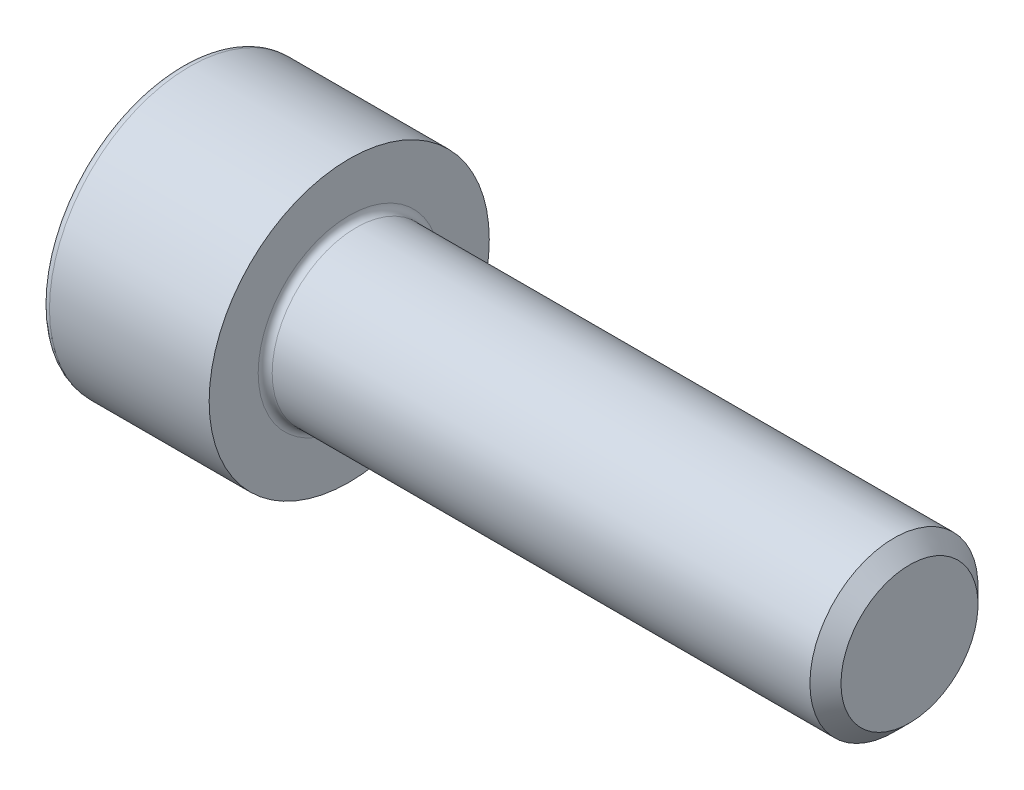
ISO-10303-21;
HEADER;
FILE_DESCRIPTION(('STEP AP214'),'2;1');
FILE_NAME('part.step','',(''),(''),'','','');
FILE_SCHEMA(('AUTOMOTIVE_DESIGN { 1 0 10303 214 1 1 1 1 }'));
ENDSEC;
DATA;
#1=APPLICATION_CONTEXT('core data for automotive mechanical design processes');
#2=APPLICATION_PROTOCOL_DEFINITION('international standard','automotive_design',2000,#1);
#3=PRODUCT_CONTEXT('',#1,'mechanical');
#4=PRODUCT('Part','Part','',(#3));
#5=PRODUCT_RELATED_PRODUCT_CATEGORY('part','',(#4));
#6=PRODUCT_DEFINITION_FORMATION('','',#4);
#7=PRODUCT_DEFINITION_CONTEXT('part definition',#1,'design');
#8=PRODUCT_DEFINITION('design','',#6,#7);
#9=PRODUCT_DEFINITION_SHAPE('','',#8);
#10=(LENGTH_UNIT() NAMED_UNIT(*) SI_UNIT(.MILLI.,.METRE.));
#11=(NAMED_UNIT(*) PLANE_ANGLE_UNIT() SI_UNIT($,.RADIAN.));
#12=(NAMED_UNIT(*) SI_UNIT($,.STERADIAN.) SOLID_ANGLE_UNIT());
#13=UNCERTAINTY_MEASURE_WITH_UNIT(LENGTH_MEASURE(1.E-05),#10,'distance_accuracy_value','');
#14=(GEOMETRIC_REPRESENTATION_CONTEXT(3) GLOBAL_UNCERTAINTY_ASSIGNED_CONTEXT((#13)) GLOBAL_UNIT_ASSIGNED_CONTEXT((#10,
#11,#12)) REPRESENTATION_CONTEXT('',''));
#15=CARTESIAN_POINT('',(0.,0.,0.));
#16=DIRECTION('',(0.,0.,1.));
#17=DIRECTION('',(1.,0.,0.));
#18=AXIS2_PLACEMENT_3D('',#15,#16,#17);
#19=CARTESIAN_POINT('',(0.,0.,0.));
#20=DIRECTION('',(-1.,0.,0.));
#21=DIRECTION('',(0.,0.,1.));
#22=AXIS2_PLACEMENT_3D('',#19,#20,#21);
#23=PLANE('',#22);
#24=DIRECTION('',(0.,-0.499999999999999,0.866025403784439));
#25=VECTOR('',#24,1.);
#26=CARTESIAN_POINT('',(0.,2.93524876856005,0.));
#27=LINE('',#26,#25);
#28=CARTESIAN_POINT('',(0.,2.93524876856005,0.));
#29=VERTEX_POINT('',#28);
#30=CARTESIAN_POINT('',(0.,1.46762438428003,2.542));
#31=VERTEX_POINT('',#30);
#32=EDGE_CURVE('E117',#29,#31,#27,.T.);
#33=ORIENTED_EDGE('',*,*,#32,.T.);
#34=DIRECTION('',(0.,1.,0.));
#35=VECTOR('',#34,1.);
#36=CARTESIAN_POINT('',(0.,-1.46762438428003,2.542));
#37=LINE('',#36,#35);
#38=CARTESIAN_POINT('',(0.,-1.46762438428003,2.542));
#39=VERTEX_POINT('',#38);
#40=EDGE_CURVE('E106',#39,#31,#37,.T.);
#41=ORIENTED_EDGE('',*,*,#40,.F.);
#42=DIRECTION('',(0.,-0.500000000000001,-0.866025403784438));
#43=VECTOR('',#42,1.);
#44=CARTESIAN_POINT('',(0.,-1.46762438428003,2.542));
#45=LINE('',#44,#43);
#46=CARTESIAN_POINT('',(0.,-2.93524876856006,0.));
#47=VERTEX_POINT('',#46);
#48=EDGE_CURVE('E116',#39,#47,#45,.T.);
#49=ORIENTED_EDGE('',*,*,#48,.T.);
#50=DIRECTION('',(0.,0.499999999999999,-0.866025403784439));
#51=VECTOR('',#50,1.);
#52=CARTESIAN_POINT('',(0.,-2.93524876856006,0.));
#53=LINE('',#52,#51);
#54=CARTESIAN_POINT('',(0.,-1.46762438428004,-2.542));
#55=VERTEX_POINT('',#54);
#56=EDGE_CURVE('E135',#47,#55,#53,.T.);
#57=ORIENTED_EDGE('',*,*,#56,.T.);
#58=DIRECTION('',(0.,-1.,0.));
#59=VECTOR('',#58,1.);
#60=CARTESIAN_POINT('',(0.,1.46762438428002,-2.542));
#61=LINE('',#60,#59);
#62=CARTESIAN_POINT('',(0.,1.46762438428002,-2.542));
#63=VERTEX_POINT('',#62);
#64=EDGE_CURVE('E138',#63,#55,#61,.T.);
#65=ORIENTED_EDGE('',*,*,#64,.F.);
#66=DIRECTION('',(0.,-0.500000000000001,-0.866025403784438));
#67=VECTOR('',#66,1.);
#68=CARTESIAN_POINT('',(0.,2.93524876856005,0.));
#69=LINE('',#68,#67);
#70=EDGE_CURVE('E131',#29,#63,#69,.T.);
#71=ORIENTED_EDGE('',*,*,#70,.F.);
#72=EDGE_LOOP('',(#33,#41,#49,#57,#65,#71));
#73=FACE_BOUND('',#72,.T.);
#74=CARTESIAN_POINT('',(0.,0.,0.));
#75=DIRECTION('',(-1.,0.,0.));
#76=DIRECTION('',(0.,0.,1.));
#77=AXIS2_PLACEMENT_3D('',#74,#75,#76);
#78=CIRCLE('',#77,4.7);
#79=CARTESIAN_POINT('',(0.,0.,4.7));
#80=VERTEX_POINT('',#79);
#81=EDGE_CURVE('E42',#80,#80,#78,.T.);
#82=ORIENTED_EDGE('',*,*,#81,.T.);
#83=EDGE_LOOP('',(#82));
#84=FACE_BOUND('',#83,.T.);
#85=ADVANCED_FACE('F35',(#73,#84),#23,.T.);
#86=CARTESIAN_POINT('',(-31.75,0.,0.));
#87=DIRECTION('',(-1.,0.,0.));
#88=DIRECTION('',(0.,0.,1.));
#89=AXIS2_PLACEMENT_3D('',#86,#87,#88);
#90=CYLINDRICAL_SURFACE('',#89,5.);
#91=CARTESIAN_POINT('',(0.300000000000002,0.,0.));
#92=DIRECTION('',(-1.,0.,0.));
#93=DIRECTION('',(0.,0.,1.));
#94=AXIS2_PLACEMENT_3D('',#91,#92,#93);
#95=CIRCLE('',#94,5.);
#96=CARTESIAN_POINT('',(0.300000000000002,0.,5.));
#97=VERTEX_POINT('',#96);
#98=EDGE_CURVE('E11',#97,#97,#95,.F.);
#99=ORIENTED_EDGE('',*,*,#98,.T.);
#100=EDGE_LOOP('',(#99));
#101=FACE_BOUND('',#100,.T.);
#102=CARTESIAN_POINT('',(6.,0.,0.));
#103=DIRECTION('',(-1.,0.,0.));
#104=DIRECTION('',(0.,0.,1.));
#105=AXIS2_PLACEMENT_3D('',#102,#103,#104);
#106=CIRCLE('',#105,5.);
#107=CARTESIAN_POINT('',(6.,0.,5.));
#108=VERTEX_POINT('',#107);
#109=EDGE_CURVE('E183',#108,#108,#106,.T.);
#110=ORIENTED_EDGE('',*,*,#109,.T.);
#111=EDGE_LOOP('',(#110));
#112=FACE_BOUND('',#111,.T.);
#113=ADVANCED_FACE('F210',(#101,#112),#90,.T.);
#114=CARTESIAN_POINT('',(6.,5.,0.));
#115=DIRECTION('',(1.,0.,0.));
#116=DIRECTION('',(0.,0.,-1.));
#117=AXIS2_PLACEMENT_3D('',#114,#115,#116);
#118=PLANE('',#117);
#119=CARTESIAN_POINT('',(6.,0.,0.));
#120=DIRECTION('',(1.,0.,0.));
#121=DIRECTION('',(0.,0.,-1.));
#122=AXIS2_PLACEMENT_3D('',#119,#120,#121);
#123=CIRCLE('',#122,3.25);
#124=CARTESIAN_POINT('',(6.,0.,-3.25));
#125=VERTEX_POINT('',#124);
#126=EDGE_CURVE('E186',#125,#125,#123,.F.);
#127=ORIENTED_EDGE('',*,*,#126,.T.);
#128=EDGE_LOOP('',(#127));
#129=FACE_BOUND('',#128,.T.);
#130=ORIENTED_EDGE('',*,*,#109,.F.);
#131=EDGE_LOOP('',(#130));
#132=FACE_BOUND('',#131,.T.);
#133=ADVANCED_FACE('F214',(#129,#132),#118,.T.);
#134=CARTESIAN_POINT('',(-31.75,0.,0.));
#135=DIRECTION('',(-1.,0.,0.));
#136=DIRECTION('',(0.,0.,1.));
#137=AXIS2_PLACEMENT_3D('',#134,#135,#136);
#138=CYLINDRICAL_SURFACE('',#137,3.);
#139=CARTESIAN_POINT('',(6.25,0.,0.));
#140=DIRECTION('',(1.,0.,0.));
#141=DIRECTION('',(0.,0.,-1.));
#142=AXIS2_PLACEMENT_3D('',#139,#140,#141);
#143=CIRCLE('',#142,3.);
#144=CARTESIAN_POINT('',(6.25,0.,-3.));
#145=VERTEX_POINT('',#144);
#146=EDGE_CURVE('E189',#145,#145,#143,.T.);
#147=ORIENTED_EDGE('',*,*,#146,.T.);
#148=EDGE_LOOP('',(#147));
#149=FACE_BOUND('',#148,.T.);
#150=CARTESIAN_POINT('',(25.4455,0.,0.));
#151=DIRECTION('',(-1.,0.,0.));
#152=DIRECTION('',(0.,0.,1.));
#153=AXIS2_PLACEMENT_3D('',#150,#151,#152);
#154=CIRCLE('',#153,3.);
#155=CARTESIAN_POINT('',(25.4455,0.,3.));
#156=VERTEX_POINT('',#155);
#157=EDGE_CURVE('E180',#156,#156,#154,.T.);
#158=ORIENTED_EDGE('',*,*,#157,.T.);
#159=EDGE_LOOP('',(#158));
#160=FACE_BOUND('',#159,.T.);
#161=ADVANCED_FACE('F219',(#149,#160),#138,.T.);
#162=CARTESIAN_POINT('',(26.,0.,0.));
#163=DIRECTION('',(-1.,0.,0.));
#164=DIRECTION('',(0.,0.,1.));
#165=AXIS2_PLACEMENT_3D('',#162,#163,#164);
#166=CONICAL_SURFACE('',#165,2.4455,0.785398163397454);
#167=ORIENTED_EDGE('',*,*,#157,.F.);
#168=EDGE_LOOP('',(#167));
#169=FACE_BOUND('',#168,.T.);
#170=CARTESIAN_POINT('',(26.,0.,0.));
#171=DIRECTION('',(-1.,0.,0.));
#172=DIRECTION('',(0.,0.,1.));
#173=AXIS2_PLACEMENT_3D('',#170,#171,#172);
#174=CIRCLE('',#173,2.4455);
#175=CARTESIAN_POINT('',(26.,0.,2.4455));
#176=VERTEX_POINT('',#175);
#177=EDGE_CURVE('E176',#176,#176,#174,.T.);
#178=ORIENTED_EDGE('',*,*,#177,.T.);
#179=EDGE_LOOP('',(#178));
#180=FACE_BOUND('',#179,.T.);
#181=ADVANCED_FACE('F226',(#169,#180),#166,.T.);
#182=CARTESIAN_POINT('',(26.,2.4455,0.));
#183=DIRECTION('',(1.,0.,0.));
#184=DIRECTION('',(0.,0.,-1.));
#185=AXIS2_PLACEMENT_3D('',#182,#183,#184);
#186=PLANE('',#185);
#187=ORIENTED_EDGE('',*,*,#177,.F.);
#188=EDGE_LOOP('',(#187));
#189=FACE_BOUND('',#188,.T.);
#190=ADVANCED_FACE('F204',(#189),#186,.T.);
#191=CARTESIAN_POINT('',(6.25,0.,0.));
#192=DIRECTION('',(1.,0.,0.));
#193=DIRECTION('',(0.,0.,-1.));
#194=AXIS2_PLACEMENT_3D('',#191,#192,#193);
#195=TOROIDAL_SURFACE('',#194,3.25,0.25);
#196=ORIENTED_EDGE('',*,*,#146,.F.);
#197=EDGE_LOOP('',(#196));
#198=FACE_BOUND('',#197,.T.);
#199=ORIENTED_EDGE('',*,*,#126,.F.);
#200=EDGE_LOOP('',(#199));
#201=FACE_BOUND('',#200,.T.);
#202=ADVANCED_FACE('F196',(#198,#201),#195,.F.);
#203=CARTESIAN_POINT('',(0.300000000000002,0.,0.));
#204=DIRECTION('',(-1.,0.,0.));
#205=DIRECTION('',(0.,0.,1.));
#206=AXIS2_PLACEMENT_3D('',#203,#204,#205);
#207=TOROIDAL_SURFACE('',#206,4.7,0.3);
#208=ORIENTED_EDGE('',*,*,#98,.F.);
#209=EDGE_LOOP('',(#208));
#210=FACE_BOUND('',#209,.T.);
#211=ORIENTED_EDGE('',*,*,#81,.F.);
#212=EDGE_LOOP('',(#211));
#213=FACE_BOUND('',#212,.T.);
#214=ADVANCED_FACE('F194',(#210,#213),#207,.T.);
#215=CARTESIAN_POINT('',(3.,2.93524876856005,0.));
#216=DIRECTION('',(0.,-0.866025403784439,-0.499999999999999));
#217=DIRECTION('',(0.,0.499999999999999,-0.866025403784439));
#218=AXIS2_PLACEMENT_3D('',#215,#216,#217);
#219=PLANE('',#218);
#220=ORIENTED_EDGE('',*,*,#32,.F.);
#221=DIRECTION('',(-1.,0.,0.));
#222=VECTOR('',#221,1.);
#223=CARTESIAN_POINT('',(3.,2.93524876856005,0.));
#224=LINE('',#223,#222);
#225=CARTESIAN_POINT('',(3.,2.93524876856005,0.));
#226=VERTEX_POINT('',#225);
#227=EDGE_CURVE('E161',#226,#29,#224,.T.);
#228=ORIENTED_EDGE('',*,*,#227,.F.);
#229=DIRECTION('',(0.,-0.499999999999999,0.866025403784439));
#230=VECTOR('',#229,1.);
#231=CARTESIAN_POINT('',(3.,2.93524876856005,0.));
#232=LINE('',#231,#230);
#233=CARTESIAN_POINT('',(3.,2.20143657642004,1.271));
#234=VERTEX_POINT('',#233);
#235=EDGE_CURVE('E141',#226,#234,#232,.T.);
#236=ORIENTED_EDGE('',*,*,#235,.T.);
#237=CARTESIAN_POINT('',(3.,1.46762438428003,2.542));
#238=VERTEX_POINT('',#237);
#239=EDGE_CURVE('E125',#234,#238,#232,.T.);
#240=ORIENTED_EDGE('',*,*,#239,.T.);
#241=DIRECTION('',(-1.,0.,0.));
#242=VECTOR('',#241,1.);
#243=CARTESIAN_POINT('',(3.,1.46762438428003,2.542));
#244=LINE('',#243,#242);
#245=EDGE_CURVE('E110',#238,#31,#244,.T.);
#246=ORIENTED_EDGE('',*,*,#245,.T.);
#247=EDGE_LOOP('',(#220,#228,#236,#240,#246));
#248=FACE_BOUND('',#247,.T.);
#249=ADVANCED_FACE('F121',(#248),#219,.T.);
#250=CARTESIAN_POINT('',(3.,-1.46762438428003,2.542));
#251=DIRECTION('',(0.,0.,1.));
#252=DIRECTION('',(0.,-1.,0.));
#253=AXIS2_PLACEMENT_3D('',#250,#251,#252);
#254=PLANE('',#253);
#255=ORIENTED_EDGE('',*,*,#40,.T.);
#256=ORIENTED_EDGE('',*,*,#245,.F.);
#257=DIRECTION('',(0.,1.,0.));
#258=VECTOR('',#257,1.);
#259=CARTESIAN_POINT('',(3.,-1.46762438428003,2.542));
#260=LINE('',#259,#258);
#261=CARTESIAN_POINT('',(3.,0.,2.542));
#262=VERTEX_POINT('',#261);
#263=EDGE_CURVE('E143',#262,#238,#260,.T.);
#264=ORIENTED_EDGE('',*,*,#263,.F.);
#265=CARTESIAN_POINT('',(3.,-1.46762438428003,2.542));
#266=VERTEX_POINT('',#265);
#267=EDGE_CURVE('E144',#266,#262,#260,.T.);
#268=ORIENTED_EDGE('',*,*,#267,.F.);
#269=DIRECTION('',(-1.,0.,0.));
#270=VECTOR('',#269,1.);
#271=CARTESIAN_POINT('',(3.,-1.46762438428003,2.542));
#272=LINE('',#271,#270);
#273=EDGE_CURVE('E112',#266,#39,#272,.T.);
#274=ORIENTED_EDGE('',*,*,#273,.T.);
#275=EDGE_LOOP('',(#255,#256,#264,#268,#274));
#276=FACE_BOUND('',#275,.T.);
#277=ADVANCED_FACE('F108',(#276),#254,.F.);
#278=CARTESIAN_POINT('',(3.,-1.46762438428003,2.542));
#279=DIRECTION('',(0.,0.866025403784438,-0.500000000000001));
#280=DIRECTION('',(0.,0.500000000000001,0.866025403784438));
#281=AXIS2_PLACEMENT_3D('',#278,#279,#280);
#282=PLANE('',#281);
#283=ORIENTED_EDGE('',*,*,#48,.F.);
#284=ORIENTED_EDGE('',*,*,#273,.F.);
#285=DIRECTION('',(0.,-0.500000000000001,-0.866025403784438));
#286=VECTOR('',#285,1.);
#287=CARTESIAN_POINT('',(3.,-1.46762438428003,2.542));
#288=LINE('',#287,#286);
#289=CARTESIAN_POINT('',(3.,-2.20143657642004,1.271));
#290=VERTEX_POINT('',#289);
#291=EDGE_CURVE('E148',#266,#290,#288,.T.);
#292=ORIENTED_EDGE('',*,*,#291,.T.);
#293=CARTESIAN_POINT('',(3.,-2.93524876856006,0.));
#294=VERTEX_POINT('',#293);
#295=EDGE_CURVE('E147',#290,#294,#288,.T.);
#296=ORIENTED_EDGE('',*,*,#295,.T.);
#297=DIRECTION('',(-1.,0.,0.));
#298=VECTOR('',#297,1.);
#299=CARTESIAN_POINT('',(3.,-2.93524876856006,0.));
#300=LINE('',#299,#298);
#301=EDGE_CURVE('E169',#294,#47,#300,.T.);
#302=ORIENTED_EDGE('',*,*,#301,.T.);
#303=EDGE_LOOP('',(#283,#284,#292,#296,#302));
#304=FACE_BOUND('',#303,.T.);
#305=ADVANCED_FACE('F277',(#304),#282,.T.);
#306=CARTESIAN_POINT('',(3.,-2.93524876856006,0.));
#307=DIRECTION('',(0.,0.866025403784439,0.499999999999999));
#308=DIRECTION('',(0.,-0.499999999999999,0.866025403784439));
#309=AXIS2_PLACEMENT_3D('',#306,#307,#308);
#310=PLANE('',#309);
#311=ORIENTED_EDGE('',*,*,#56,.F.);
#312=ORIENTED_EDGE('',*,*,#301,.F.);
#313=DIRECTION('',(0.,0.499999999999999,-0.866025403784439));
#314=VECTOR('',#313,1.);
#315=CARTESIAN_POINT('',(3.,-2.93524876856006,0.));
#316=LINE('',#315,#314);
#317=CARTESIAN_POINT('',(3.,-2.20143657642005,-1.271));
#318=VERTEX_POINT('',#317);
#319=EDGE_CURVE('E152',#294,#318,#316,.T.);
#320=ORIENTED_EDGE('',*,*,#319,.T.);
#321=CARTESIAN_POINT('',(3.,-1.46762438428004,-2.542));
#322=VERTEX_POINT('',#321);
#323=EDGE_CURVE('E151',#318,#322,#316,.T.);
#324=ORIENTED_EDGE('',*,*,#323,.T.);
#325=DIRECTION('',(-1.,0.,0.));
#326=VECTOR('',#325,1.);
#327=CARTESIAN_POINT('',(3.,-1.46762438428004,-2.542));
#328=LINE('',#327,#326);
#329=EDGE_CURVE('E166',#322,#55,#328,.T.);
#330=ORIENTED_EDGE('',*,*,#329,.T.);
#331=EDGE_LOOP('',(#311,#312,#320,#324,#330));
#332=FACE_BOUND('',#331,.T.);
#333=ADVANCED_FACE('F286',(#332),#310,.T.);
#334=CARTESIAN_POINT('',(3.,1.46762438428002,-2.542));
#335=DIRECTION('',(0.,0.,-1.));
#336=DIRECTION('',(0.,1.,0.));
#337=AXIS2_PLACEMENT_3D('',#334,#335,#336);
#338=PLANE('',#337);
#339=ORIENTED_EDGE('',*,*,#64,.T.);
#340=ORIENTED_EDGE('',*,*,#329,.F.);
#341=DIRECTION('',(0.,-1.,0.));
#342=VECTOR('',#341,1.);
#343=CARTESIAN_POINT('',(3.,1.46762438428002,-2.542));
#344=LINE('',#343,#342);
#345=CARTESIAN_POINT('',(3.,0.,-2.542));
#346=VERTEX_POINT('',#345);
#347=EDGE_CURVE('E155',#346,#322,#344,.T.);
#348=ORIENTED_EDGE('',*,*,#347,.F.);
#349=CARTESIAN_POINT('',(3.,1.46762438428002,-2.542));
#350=VERTEX_POINT('',#349);
#351=EDGE_CURVE('E49',#350,#346,#344,.T.);
#352=ORIENTED_EDGE('',*,*,#351,.F.);
#353=DIRECTION('',(-1.,0.,0.));
#354=VECTOR('',#353,1.);
#355=CARTESIAN_POINT('',(3.,1.46762438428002,-2.542));
#356=LINE('',#355,#354);
#357=EDGE_CURVE('E163',#350,#63,#356,.T.);
#358=ORIENTED_EDGE('',*,*,#357,.T.);
#359=EDGE_LOOP('',(#339,#340,#348,#352,#358));
#360=FACE_BOUND('',#359,.T.);
#361=ADVANCED_FACE('F296',(#360),#338,.F.);
#362=CARTESIAN_POINT('',(3.,2.93524876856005,0.));
#363=DIRECTION('',(0.,0.866025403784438,-0.500000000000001));
#364=DIRECTION('',(0.,0.500000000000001,0.866025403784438));
#365=AXIS2_PLACEMENT_3D('',#362,#363,#364);
#366=PLANE('',#365);
#367=ORIENTED_EDGE('',*,*,#70,.T.);
#368=ORIENTED_EDGE('',*,*,#357,.F.);
#369=DIRECTION('',(0.,-0.500000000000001,-0.866025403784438));
#370=VECTOR('',#369,1.);
#371=CARTESIAN_POINT('',(3.,2.93524876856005,0.));
#372=LINE('',#371,#370);
#373=CARTESIAN_POINT('',(3.,2.20143657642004,-1.271));
#374=VERTEX_POINT('',#373);
#375=EDGE_CURVE('E157',#374,#350,#372,.T.);
#376=ORIENTED_EDGE('',*,*,#375,.F.);
#377=EDGE_CURVE('E158',#226,#374,#372,.T.);
#378=ORIENTED_EDGE('',*,*,#377,.F.);
#379=ORIENTED_EDGE('',*,*,#227,.T.);
#380=EDGE_LOOP('',(#367,#368,#376,#378,#379));
#381=FACE_BOUND('',#380,.T.);
#382=ADVANCED_FACE('F306',(#381),#366,.F.);
#383=CARTESIAN_POINT('',(3.,2.93524876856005,0.));
#384=DIRECTION('',(1.,0.,0.));
#385=DIRECTION('',(0.,0.,-1.));
#386=AXIS2_PLACEMENT_3D('',#383,#384,#385);
#387=PLANE('',#386);
#388=ORIENTED_EDGE('',*,*,#347,.T.);
#389=ORIENTED_EDGE('',*,*,#323,.F.);
#390=CARTESIAN_POINT('',(3.,0.,0.));
#391=DIRECTION('',(-1.,0.,0.));
#392=DIRECTION('',(0.,0.,1.));
#393=AXIS2_PLACEMENT_3D('',#390,#391,#392);
#394=CIRCLE('',#393,2.542);
#395=EDGE_CURVE('E392',#346,#318,#394,.T.);
#396=ORIENTED_EDGE('',*,*,#395,.F.);
#397=EDGE_LOOP('',(#388,#389,#396));
#398=FACE_BOUND('',#397,.T.);
#399=ADVANCED_FACE('F316',(#398),#387,.F.);
#400=ORIENTED_EDGE('',*,*,#319,.F.);
#401=ORIENTED_EDGE('',*,*,#295,.F.);
#402=EDGE_CURVE('E390',#318,#290,#394,.T.);
#403=ORIENTED_EDGE('',*,*,#402,.F.);
#404=EDGE_LOOP('',(#400,#401,#403));
#405=FACE_BOUND('',#404,.T.);
#406=ADVANCED_FACE('F326',(#405),#387,.F.);
#407=ORIENTED_EDGE('',*,*,#291,.F.);
#408=ORIENTED_EDGE('',*,*,#267,.T.);
#409=EDGE_CURVE('E126',#290,#262,#394,.T.);
#410=ORIENTED_EDGE('',*,*,#409,.F.);
#411=EDGE_LOOP('',(#407,#408,#410));
#412=FACE_BOUND('',#411,.T.);
#413=ADVANCED_FACE('F337',(#412),#387,.F.);
#414=ORIENTED_EDGE('',*,*,#263,.T.);
#415=ORIENTED_EDGE('',*,*,#239,.F.);
#416=EDGE_CURVE('E173',#262,#234,#394,.T.);
#417=ORIENTED_EDGE('',*,*,#416,.F.);
#418=EDGE_LOOP('',(#414,#415,#417));
#419=FACE_BOUND('',#418,.T.);
#420=ADVANCED_FACE('F346',(#419),#387,.F.);
#421=ORIENTED_EDGE('',*,*,#235,.F.);
#422=ORIENTED_EDGE('',*,*,#377,.T.);
#423=EDGE_CURVE('E177',#234,#374,#394,.T.);
#424=ORIENTED_EDGE('',*,*,#423,.F.);
#425=EDGE_LOOP('',(#421,#422,#424));
#426=FACE_BOUND('',#425,.T.);
#427=ADVANCED_FACE('F355',(#426),#387,.F.);
#428=ORIENTED_EDGE('',*,*,#375,.T.);
#429=ORIENTED_EDGE('',*,*,#351,.T.);
#430=EDGE_CURVE('E395',#374,#346,#394,.T.);
#431=ORIENTED_EDGE('',*,*,#430,.F.);
#432=EDGE_LOOP('',(#428,#429,#431));
#433=FACE_BOUND('',#432,.T.);
#434=ADVANCED_FACE('F329',(#433),#387,.F.);
#435=CARTESIAN_POINT('',(3.,0.,0.));
#436=DIRECTION('',(-1.,0.,0.));
#437=DIRECTION('',(0.,0.,1.));
#438=AXIS2_PLACEMENT_3D('',#435,#436,#437);
#439=CONICAL_SURFACE('',#438,2.542,1.04719755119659);
#440=CARTESIAN_POINT('',(4.46762438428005,0.,0.));
#441=VERTEX_POINT('',#440);
#442=VERTEX_LOOP('',#441);
#443=FACE_BOUND('',#442,.T.);
#444=ORIENTED_EDGE('',*,*,#416,.T.);
#445=ORIENTED_EDGE('',*,*,#423,.T.);
#446=ORIENTED_EDGE('',*,*,#430,.T.);
#447=ORIENTED_EDGE('',*,*,#395,.T.);
#448=ORIENTED_EDGE('',*,*,#402,.T.);
#449=ORIENTED_EDGE('',*,*,#409,.T.);
#450=EDGE_LOOP('',(#444,#445,#446,#447,#448,#449));
#451=FACE_BOUND('',#450,.T.);
#452=ADVANCED_FACE('F372',(#443,#451),#439,.F.);
#453=CLOSED_SHELL('',(#85,#113,#133,#161,#181,#190,#202,#214,#249,#277,#305,#333,#361,#382,#399,
#406,#413,#420,#427,#434,#452));
#454=MANIFOLD_SOLID_BREP('B2',#453);
#455=ADVANCED_BREP_SHAPE_REPRESENTATION('',(#18,#454),#14);
#456=SHAPE_DEFINITION_REPRESENTATION(#9,#455);
ENDSEC;
END-ISO-10303-21;
